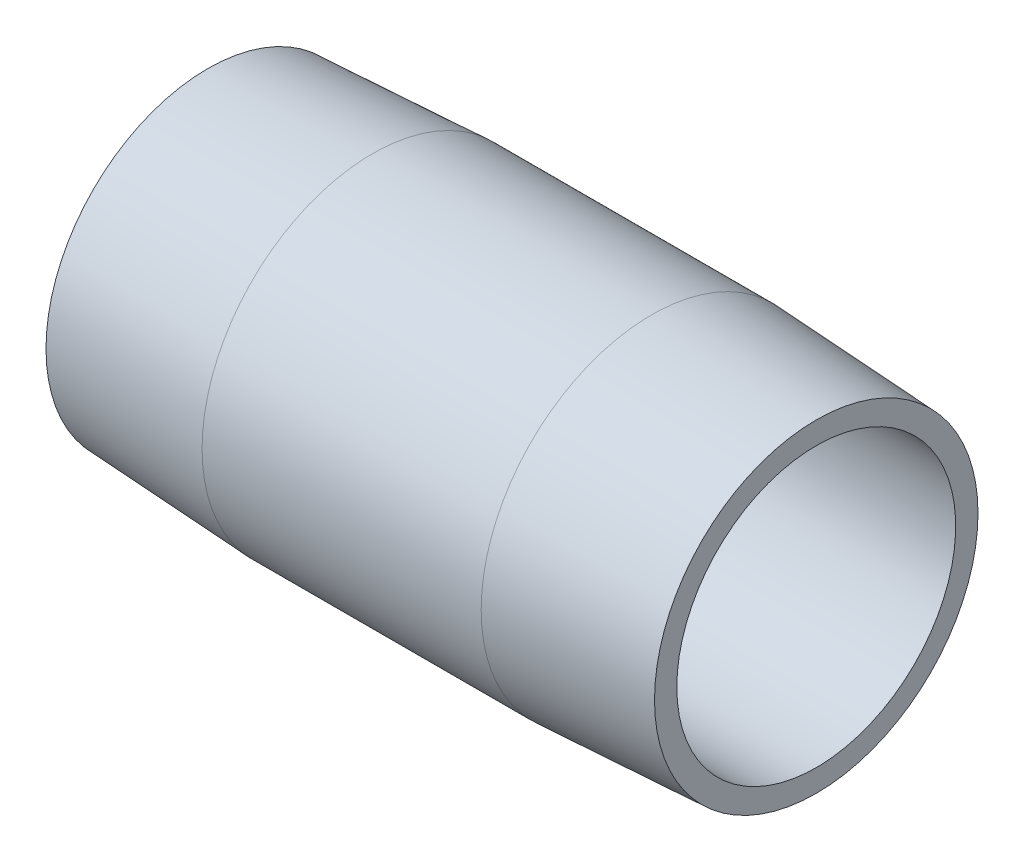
ISO-10303-21;
HEADER;
FILE_DESCRIPTION(('STEP AP214'),'2;1');
FILE_NAME('part.step','',(''),(''),'','','');
FILE_SCHEMA(('AUTOMOTIVE_DESIGN { 1 0 10303 214 1 1 1 1 }'));
ENDSEC;
DATA;
#1=APPLICATION_CONTEXT('core data for automotive mechanical design processes');
#2=APPLICATION_PROTOCOL_DEFINITION('international standard','automotive_design',2000,#1);
#3=PRODUCT_CONTEXT('',#1,'mechanical');
#4=PRODUCT('Part','Part','',(#3));
#5=PRODUCT_RELATED_PRODUCT_CATEGORY('part','',(#4));
#6=PRODUCT_DEFINITION_FORMATION('','',#4);
#7=PRODUCT_DEFINITION_CONTEXT('part definition',#1,'design');
#8=PRODUCT_DEFINITION('design','',#6,#7);
#9=PRODUCT_DEFINITION_SHAPE('','',#8);
#10=(LENGTH_UNIT() NAMED_UNIT(*) SI_UNIT(.MILLI.,.METRE.));
#11=(NAMED_UNIT(*) PLANE_ANGLE_UNIT() SI_UNIT($,.RADIAN.));
#12=(NAMED_UNIT(*) SI_UNIT($,.STERADIAN.) SOLID_ANGLE_UNIT());
#13=UNCERTAINTY_MEASURE_WITH_UNIT(LENGTH_MEASURE(1.E-05),#10,'distance_accuracy_value','');
#14=(GEOMETRIC_REPRESENTATION_CONTEXT(3) GLOBAL_UNCERTAINTY_ASSIGNED_CONTEXT((#13)) GLOBAL_UNIT_ASSIGNED_CONTEXT((#10,
#11,#12)) REPRESENTATION_CONTEXT('',''));
#15=CARTESIAN_POINT('',(0.,0.,0.));
#16=DIRECTION('',(0.,0.,1.));
#17=DIRECTION('',(1.,0.,0.));
#18=AXIS2_PLACEMENT_3D('',#15,#16,#17);
#19=CARTESIAN_POINT('',(38.1,8.73125,0.));
#20=DIRECTION('',(-1.,0.,0.));
#21=DIRECTION('',(0.,0.,1.));
#22=AXIS2_PLACEMENT_3D('',#19,#20,#21);
#23=PLANE('',#22);
#24=CARTESIAN_POINT('',(38.1,0.,0.));
#25=DIRECTION('',(-1.,0.,0.));
#26=DIRECTION('',(0.,0.,1.));
#27=AXIS2_PLACEMENT_3D('',#24,#25,#26);
#28=CIRCLE('',#27,10.1275500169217);
#29=CARTESIAN_POINT('',(38.1,0.,10.1275500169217));
#30=VERTEX_POINT('',#29);
#31=EDGE_CURVE('E10',#30,#30,#28,.T.);
#32=ORIENTED_EDGE('',*,*,#31,.F.);
#33=EDGE_LOOP('',(#32));
#34=FACE_BOUND('',#33,.T.);
#35=CARTESIAN_POINT('',(38.1,0.,0.));
#36=DIRECTION('',(-1.,0.,0.));
#37=DIRECTION('',(0.,0.,1.));
#38=AXIS2_PLACEMENT_3D('',#35,#36,#37);
#39=CIRCLE('',#38,8.73125);
#40=CARTESIAN_POINT('',(38.1,0.,8.73125));
#41=VERTEX_POINT('',#40);
#42=EDGE_CURVE('E52',#41,#41,#39,.T.);
#43=ORIENTED_EDGE('',*,*,#42,.T.);
#44=EDGE_LOOP('',(#43));
#45=FACE_BOUND('',#44,.T.);
#46=ADVANCED_FACE('F30',(#34,#45),#23,.F.);
#47=CARTESIAN_POINT('',(38.1,0.,0.));
#48=DIRECTION('',(-1.,0.,0.));
#49=DIRECTION('',(0.,0.,1.));
#50=AXIS2_PLACEMENT_3D('',#47,#48,#49);
#51=CONICAL_SURFACE('',#50,10.1275500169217,0.0523598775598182);
#52=CARTESIAN_POINT('',(27.7876,0.,0.));
#53=DIRECTION('',(-1.,0.,0.));
#54=DIRECTION('',(0.,0.,1.));
#55=AXIS2_PLACEMENT_3D('',#52,#53,#54);
#56=CIRCLE('',#55,10.668);
#57=CARTESIAN_POINT('',(27.7876,0.,10.668));
#58=VERTEX_POINT('',#57);
#59=EDGE_CURVE('E36',#58,#58,#56,.T.);
#60=ORIENTED_EDGE('',*,*,#59,.F.);
#61=EDGE_LOOP('',(#60));
#62=FACE_BOUND('',#61,.T.);
#63=ORIENTED_EDGE('',*,*,#31,.T.);
#64=EDGE_LOOP('',(#63));
#65=FACE_BOUND('',#64,.T.);
#66=ADVANCED_FACE('F77',(#62,#65),#51,.T.);
#67=CARTESIAN_POINT('',(0.,0.,0.));
#68=DIRECTION('',(-1.,0.,0.));
#69=DIRECTION('',(0.,0.,1.));
#70=AXIS2_PLACEMENT_3D('',#67,#68,#69);
#71=CYLINDRICAL_SURFACE('',#70,10.668);
#72=CARTESIAN_POINT('',(10.3124,0.,0.));
#73=DIRECTION('',(-1.,0.,0.));
#74=DIRECTION('',(0.,0.,1.));
#75=AXIS2_PLACEMENT_3D('',#72,#73,#74);
#76=CIRCLE('',#75,10.668);
#77=CARTESIAN_POINT('',(10.3124,0.,10.668));
#78=VERTEX_POINT('',#77);
#79=EDGE_CURVE('E40',#78,#78,#76,.T.);
#80=ORIENTED_EDGE('',*,*,#79,.F.);
#81=EDGE_LOOP('',(#80));
#82=FACE_BOUND('',#81,.T.);
#83=ORIENTED_EDGE('',*,*,#59,.T.);
#84=EDGE_LOOP('',(#83));
#85=FACE_BOUND('',#84,.T.);
#86=ADVANCED_FACE('F72',(#82,#85),#71,.T.);
#87=CARTESIAN_POINT('',(10.3124,0.,0.));
#88=DIRECTION('',(1.,0.,0.));
#89=DIRECTION('',(0.,0.,-1.));
#90=AXIS2_PLACEMENT_3D('',#87,#88,#89);
#91=CONICAL_SURFACE('',#90,10.668,0.0523598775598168);
#92=CARTESIAN_POINT('',(0.,0.,0.));
#93=DIRECTION('',(-1.,0.,0.));
#94=DIRECTION('',(0.,0.,1.));
#95=AXIS2_PLACEMENT_3D('',#92,#93,#94);
#96=CIRCLE('',#95,10.1275500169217);
#97=CARTESIAN_POINT('',(0.,0.,10.1275500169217));
#98=VERTEX_POINT('',#97);
#99=EDGE_CURVE('E44',#98,#98,#96,.T.);
#100=ORIENTED_EDGE('',*,*,#99,.F.);
#101=EDGE_LOOP('',(#100));
#102=FACE_BOUND('',#101,.T.);
#103=ORIENTED_EDGE('',*,*,#79,.T.);
#104=EDGE_LOOP('',(#103));
#105=FACE_BOUND('',#104,.T.);
#106=ADVANCED_FACE('F66',(#102,#105),#91,.T.);
#107=CARTESIAN_POINT('',(0.,10.1275500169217,0.));
#108=DIRECTION('',(1.,0.,0.));
#109=DIRECTION('',(0.,0.,-1.));
#110=AXIS2_PLACEMENT_3D('',#107,#108,#109);
#111=PLANE('',#110);
#112=CARTESIAN_POINT('',(0.,0.,0.));
#113=DIRECTION('',(-1.,0.,0.));
#114=DIRECTION('',(0.,0.,1.));
#115=AXIS2_PLACEMENT_3D('',#112,#113,#114);
#116=CIRCLE('',#115,8.73125);
#117=CARTESIAN_POINT('',(0.,0.,8.73125));
#118=VERTEX_POINT('',#117);
#119=EDGE_CURVE('E49',#118,#118,#116,.T.);
#120=ORIENTED_EDGE('',*,*,#119,.F.);
#121=EDGE_LOOP('',(#120));
#122=FACE_BOUND('',#121,.T.);
#123=ORIENTED_EDGE('',*,*,#99,.T.);
#124=EDGE_LOOP('',(#123));
#125=FACE_BOUND('',#124,.T.);
#126=ADVANCED_FACE('F60',(#122,#125),#111,.F.);
#127=CARTESIAN_POINT('',(0.,0.,0.));
#128=DIRECTION('',(-1.,0.,0.));
#129=DIRECTION('',(0.,0.,1.));
#130=AXIS2_PLACEMENT_3D('',#127,#128,#129);
#131=CYLINDRICAL_SURFACE('',#130,8.73125);
#132=ORIENTED_EDGE('',*,*,#42,.F.);
#133=EDGE_LOOP('',(#132));
#134=FACE_BOUND('',#133,.T.);
#135=ORIENTED_EDGE('',*,*,#119,.T.);
#136=EDGE_LOOP('',(#135));
#137=FACE_BOUND('',#136,.T.);
#138=ADVANCED_FACE('F57',(#134,#137),#131,.F.);
#139=CLOSED_SHELL('',(#46,#66,#86,#106,#126,#138));
#140=MANIFOLD_SOLID_BREP('B2',#139);
#141=ADVANCED_BREP_SHAPE_REPRESENTATION('',(#18,#140),#14);
#142=SHAPE_DEFINITION_REPRESENTATION(#9,#141);
ENDSEC;
END-ISO-10303-21;
